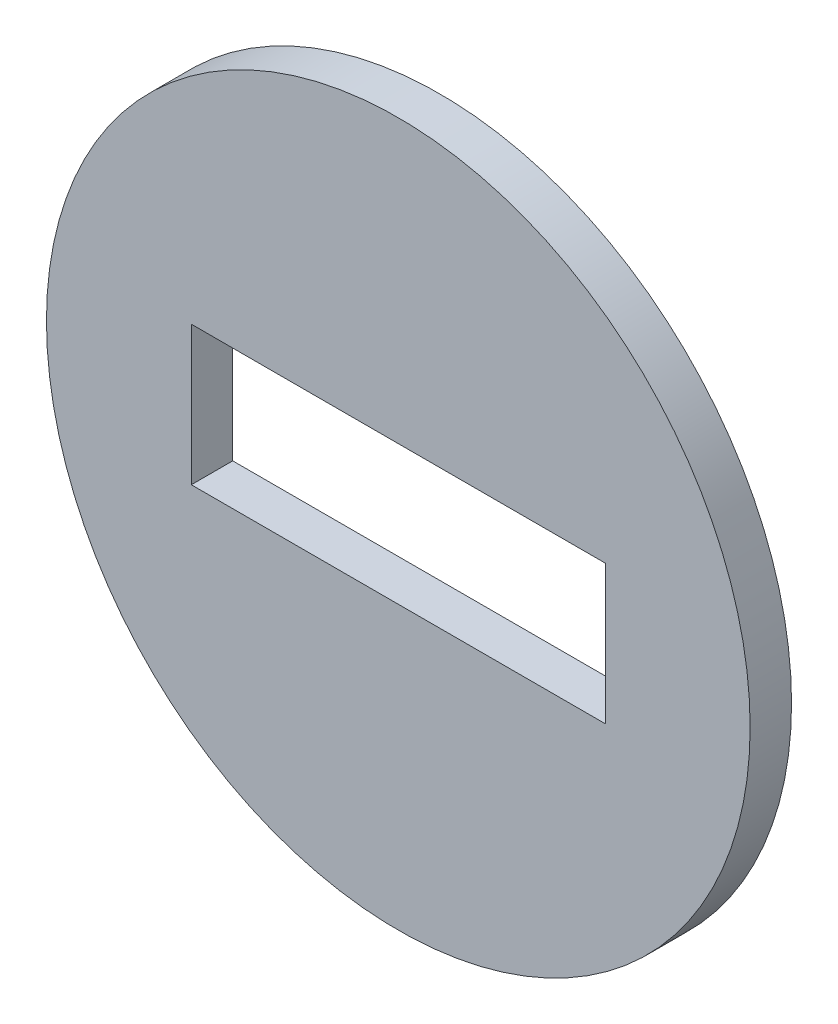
from build123d import *

# Parameters (mm, degrees)
SKETCH1_R          = 26.9875
EXTRUDE1_DEPTH     = 3.175
SKETCH2_W          = 31.75
SKETCH2_H          = 10.668
CUT_EXTRUDE1_DEPTH = 39.29792341


with BuildPart() as part:
    # Sketch1 → Extrude1 (new body)
    with BuildSketch(Plane.XY):
        Circle(SKETCH1_R)
    extrude(amount=EXTRUDE1_DEPTH)

    # Sketch2 → Cut-Extrude1 (cut, through all)
    with BuildSketch(Plane.XY.offset(3.175)):
        Rectangle(SKETCH2_W, SKETCH2_H)
    extrude(amount=-CUT_EXTRUDE1_DEPTH, mode=Mode.SUBTRACT)


solid = part.part
